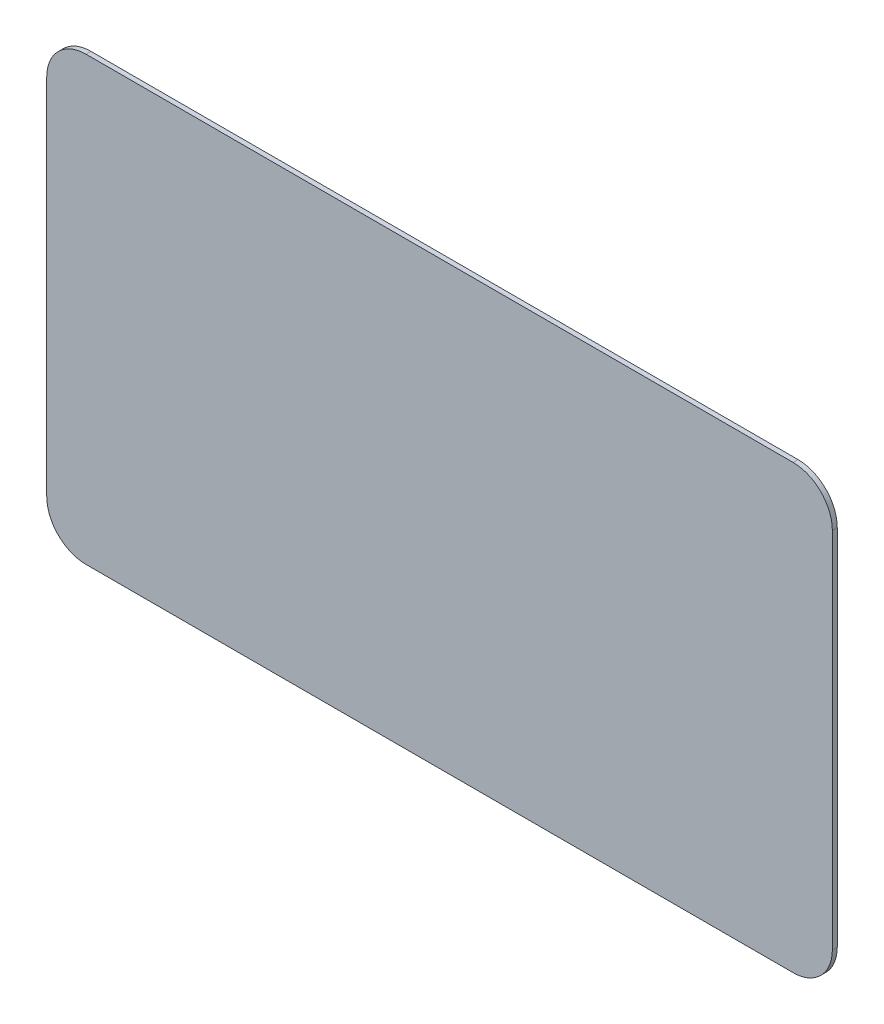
ISO-10303-21;
HEADER;
FILE_DESCRIPTION(('STEP AP214'),'2;1');
FILE_NAME('part.step','',(''),(''),'','','');
FILE_SCHEMA(('AUTOMOTIVE_DESIGN { 1 0 10303 214 1 1 1 1 }'));
ENDSEC;
DATA;
#1=APPLICATION_CONTEXT('core data for automotive mechanical design processes');
#2=APPLICATION_PROTOCOL_DEFINITION('international standard','automotive_design',2000,#1);
#3=PRODUCT_CONTEXT('',#1,'mechanical');
#4=PRODUCT('Part','Part','',(#3));
#5=PRODUCT_RELATED_PRODUCT_CATEGORY('part','',(#4));
#6=PRODUCT_DEFINITION_FORMATION('','',#4);
#7=PRODUCT_DEFINITION_CONTEXT('part definition',#1,'design');
#8=PRODUCT_DEFINITION('design','',#6,#7);
#9=PRODUCT_DEFINITION_SHAPE('','',#8);
#10=(LENGTH_UNIT() NAMED_UNIT(*) SI_UNIT(.MILLI.,.METRE.));
#11=(NAMED_UNIT(*) PLANE_ANGLE_UNIT() SI_UNIT($,.RADIAN.));
#12=(NAMED_UNIT(*) SI_UNIT($,.STERADIAN.) SOLID_ANGLE_UNIT());
#13=UNCERTAINTY_MEASURE_WITH_UNIT(LENGTH_MEASURE(1.E-05),#10,'distance_accuracy_value','');
#14=(GEOMETRIC_REPRESENTATION_CONTEXT(3) GLOBAL_UNCERTAINTY_ASSIGNED_CONTEXT((#13)) GLOBAL_UNIT_ASSIGNED_CONTEXT((#10,
#11,#12)) REPRESENTATION_CONTEXT('',''));
#15=CARTESIAN_POINT('',(0.,0.,0.));
#16=DIRECTION('',(0.,0.,1.));
#17=DIRECTION('',(1.,0.,0.));
#18=AXIS2_PLACEMENT_3D('',#15,#16,#17);
#19=CARTESIAN_POINT('',(-40.,-22.5,0.5));
#20=DIRECTION('',(1.,0.,0.));
#21=DIRECTION('',(0.,0.,-1.));
#22=AXIS2_PLACEMENT_3D('',#19,#20,#21);
#23=PLANE('',#22);
#24=DIRECTION('',(0.,-1.,0.));
#25=VECTOR('',#24,1.);
#26=CARTESIAN_POINT('',(-40.,-22.5,0.));
#27=LINE('',#26,#25);
#28=CARTESIAN_POINT('',(-40.,18.5,0.));
#29=VERTEX_POINT('',#28);
#30=CARTESIAN_POINT('',(-40.,-18.5,0.));
#31=VERTEX_POINT('',#30);
#32=EDGE_CURVE('E159',#29,#31,#27,.T.);
#33=ORIENTED_EDGE('',*,*,#32,.T.);
#34=DIRECTION('',(0.,0.,-1.));
#35=VECTOR('',#34,1.);
#36=CARTESIAN_POINT('',(-40.,-18.5,0.5));
#37=LINE('',#36,#35);
#38=CARTESIAN_POINT('',(-40.,-18.5,0.5));
#39=VERTEX_POINT('',#38);
#40=EDGE_CURVE('E11',#31,#39,#37,.F.);
#41=ORIENTED_EDGE('',*,*,#40,.T.);
#42=DIRECTION('',(0.,-1.,0.));
#43=VECTOR('',#42,1.);
#44=CARTESIAN_POINT('',(-40.,-22.5,0.5));
#45=LINE('',#44,#43);
#46=CARTESIAN_POINT('',(-40.,18.5,0.5));
#47=VERTEX_POINT('',#46);
#48=EDGE_CURVE('E127',#47,#39,#45,.T.);
#49=ORIENTED_EDGE('',*,*,#48,.F.);
#50=DIRECTION('',(0.,0.,-1.));
#51=VECTOR('',#50,1.);
#52=CARTESIAN_POINT('',(-40.,18.5,0.5));
#53=LINE('',#52,#51);
#54=EDGE_CURVE('E43',#47,#29,#53,.T.);
#55=ORIENTED_EDGE('',*,*,#54,.T.);
#56=EDGE_LOOP('',(#33,#41,#49,#55));
#57=FACE_BOUND('',#56,.T.);
#58=ADVANCED_FACE('F35',(#57),#23,.F.);
#59=CARTESIAN_POINT('',(-40.,-22.5,0.5));
#60=DIRECTION('',(0.,1.,0.));
#61=DIRECTION('',(-1.,0.,0.));
#62=AXIS2_PLACEMENT_3D('',#59,#60,#61);
#63=PLANE('',#62);
#64=DIRECTION('',(1.,0.,0.));
#65=VECTOR('',#64,1.);
#66=CARTESIAN_POINT('',(-40.,-22.5,0.));
#67=LINE('',#66,#65);
#68=CARTESIAN_POINT('',(-36.,-22.5,0.));
#69=VERTEX_POINT('',#68);
#70=CARTESIAN_POINT('',(36.,-22.5,0.));
#71=VERTEX_POINT('',#70);
#72=EDGE_CURVE('E132',#69,#71,#67,.T.);
#73=ORIENTED_EDGE('',*,*,#72,.T.);
#74=DIRECTION('',(0.,0.,-1.));
#75=VECTOR('',#74,1.);
#76=CARTESIAN_POINT('',(36.,-22.5,0.5));
#77=LINE('',#76,#75);
#78=CARTESIAN_POINT('',(36.,-22.5,0.5));
#79=VERTEX_POINT('',#78);
#80=EDGE_CURVE('E50',#71,#79,#77,.F.);
#81=ORIENTED_EDGE('',*,*,#80,.T.);
#82=DIRECTION('',(1.,0.,0.));
#83=VECTOR('',#82,1.);
#84=CARTESIAN_POINT('',(-40.,-22.5,0.5));
#85=LINE('',#84,#83);
#86=CARTESIAN_POINT('',(-36.,-22.5,0.5));
#87=VERTEX_POINT('',#86);
#88=EDGE_CURVE('E130',#87,#79,#85,.T.);
#89=ORIENTED_EDGE('',*,*,#88,.F.);
#90=DIRECTION('',(0.,0.,-1.));
#91=VECTOR('',#90,1.);
#92=CARTESIAN_POINT('',(-36.,-22.5,0.5));
#93=LINE('',#92,#91);
#94=EDGE_CURVE('E151',#87,#69,#93,.T.);
#95=ORIENTED_EDGE('',*,*,#94,.T.);
#96=EDGE_LOOP('',(#73,#81,#89,#95));
#97=FACE_BOUND('',#96,.T.);
#98=ADVANCED_FACE('F179',(#97),#63,.F.);
#99=CARTESIAN_POINT('',(40.,-22.5,0.5));
#100=DIRECTION('',(-1.,0.,0.));
#101=DIRECTION('',(0.,0.,1.));
#102=AXIS2_PLACEMENT_3D('',#99,#100,#101);
#103=PLANE('',#102);
#104=DIRECTION('',(0.,1.,0.));
#105=VECTOR('',#104,1.);
#106=CARTESIAN_POINT('',(40.,-22.5,0.));
#107=LINE('',#106,#105);
#108=CARTESIAN_POINT('',(40.,-18.5,0.));
#109=VERTEX_POINT('',#108);
#110=CARTESIAN_POINT('',(40.,18.5,0.));
#111=VERTEX_POINT('',#110);
#112=EDGE_CURVE('E128',#109,#111,#107,.T.);
#113=ORIENTED_EDGE('',*,*,#112,.T.);
#114=DIRECTION('',(0.,0.,-1.));
#115=VECTOR('',#114,1.);
#116=CARTESIAN_POINT('',(40.,18.5,0.5));
#117=LINE('',#116,#115);
#118=CARTESIAN_POINT('',(40.,18.5,0.5));
#119=VERTEX_POINT('',#118);
#120=EDGE_CURVE('E106',#111,#119,#117,.F.);
#121=ORIENTED_EDGE('',*,*,#120,.T.);
#122=DIRECTION('',(0.,1.,0.));
#123=VECTOR('',#122,1.);
#124=CARTESIAN_POINT('',(40.,-22.5,0.5));
#125=LINE('',#124,#123);
#126=CARTESIAN_POINT('',(40.,-18.5,0.5));
#127=VERTEX_POINT('',#126);
#128=EDGE_CURVE('E167',#127,#119,#125,.T.);
#129=ORIENTED_EDGE('',*,*,#128,.F.);
#130=DIRECTION('',(0.,0.,-1.));
#131=VECTOR('',#130,1.);
#132=CARTESIAN_POINT('',(40.,-18.5,0.5));
#133=LINE('',#132,#131);
#134=EDGE_CURVE('E111',#127,#109,#133,.T.);
#135=ORIENTED_EDGE('',*,*,#134,.T.);
#136=EDGE_LOOP('',(#113,#121,#129,#135));
#137=FACE_BOUND('',#136,.T.);
#138=ADVANCED_FACE('F178',(#137),#103,.F.);
#139=CARTESIAN_POINT('',(-40.,22.5,0.5));
#140=DIRECTION('',(0.,-1.,0.));
#141=DIRECTION('',(1.,0.,0.));
#142=AXIS2_PLACEMENT_3D('',#139,#140,#141);
#143=PLANE('',#142);
#144=DIRECTION('',(-1.,0.,0.));
#145=VECTOR('',#144,1.);
#146=CARTESIAN_POINT('',(-40.,22.5,0.5));
#147=LINE('',#146,#145);
#148=CARTESIAN_POINT('',(36.,22.5,0.5));
#149=VERTEX_POINT('',#148);
#150=CARTESIAN_POINT('',(-36.,22.5,0.5));
#151=VERTEX_POINT('',#150);
#152=EDGE_CURVE('E121',#149,#151,#147,.T.);
#153=ORIENTED_EDGE('',*,*,#152,.F.);
#154=DIRECTION('',(0.,0.,-1.));
#155=VECTOR('',#154,1.);
#156=CARTESIAN_POINT('',(36.,22.5,0.5));
#157=LINE('',#156,#155);
#158=CARTESIAN_POINT('',(36.,22.5,0.));
#159=VERTEX_POINT('',#158);
#160=EDGE_CURVE('E105',#149,#159,#157,.T.);
#161=ORIENTED_EDGE('',*,*,#160,.T.);
#162=DIRECTION('',(-1.,0.,0.));
#163=VECTOR('',#162,1.);
#164=CARTESIAN_POINT('',(-40.,22.5,0.));
#165=LINE('',#164,#163);
#166=CARTESIAN_POINT('',(-36.,22.5,0.));
#167=VERTEX_POINT('',#166);
#168=EDGE_CURVE('E118',#159,#167,#165,.T.);
#169=ORIENTED_EDGE('',*,*,#168,.T.);
#170=DIRECTION('',(0.,0.,-1.));
#171=VECTOR('',#170,1.);
#172=CARTESIAN_POINT('',(-36.,22.5,0.5));
#173=LINE('',#172,#171);
#174=EDGE_CURVE('E123',#167,#151,#173,.F.);
#175=ORIENTED_EDGE('',*,*,#174,.T.);
#176=EDGE_LOOP('',(#153,#161,#169,#175));
#177=FACE_BOUND('',#176,.T.);
#178=ADVANCED_FACE('F117',(#177),#143,.F.);
#179=CARTESIAN_POINT('',(0.,0.,0.5));
#180=DIRECTION('',(0.,0.,-1.));
#181=DIRECTION('',(-1.,0.,0.));
#182=AXIS2_PLACEMENT_3D('',#179,#180,#181);
#183=PLANE('',#182);
#184=ORIENTED_EDGE('',*,*,#128,.T.);
#185=CARTESIAN_POINT('',(36.,18.5,0.5));
#186=DIRECTION('',(0.,0.,-1.));
#187=DIRECTION('',(-1.,0.,0.));
#188=AXIS2_PLACEMENT_3D('',#185,#186,#187);
#189=CIRCLE('',#188,4.);
#190=EDGE_CURVE('E149',#119,#149,#189,.F.);
#191=ORIENTED_EDGE('',*,*,#190,.T.);
#192=ORIENTED_EDGE('',*,*,#152,.T.);
#193=CARTESIAN_POINT('',(-36.,18.5,0.5));
#194=DIRECTION('',(0.,0.,-1.));
#195=DIRECTION('',(-1.,0.,0.));
#196=AXIS2_PLACEMENT_3D('',#193,#194,#195);
#197=CIRCLE('',#196,4.);
#198=EDGE_CURVE('E144',#151,#47,#197,.F.);
#199=ORIENTED_EDGE('',*,*,#198,.T.);
#200=ORIENTED_EDGE('',*,*,#48,.T.);
#201=CARTESIAN_POINT('',(-36.,-18.5,0.5));
#202=DIRECTION('',(0.,0.,-1.));
#203=DIRECTION('',(-1.,0.,0.));
#204=AXIS2_PLACEMENT_3D('',#201,#202,#203);
#205=CIRCLE('',#204,4.);
#206=EDGE_CURVE('E57',#39,#87,#205,.F.);
#207=ORIENTED_EDGE('',*,*,#206,.T.);
#208=ORIENTED_EDGE('',*,*,#88,.T.);
#209=CARTESIAN_POINT('',(36.,-18.5,0.5));
#210=DIRECTION('',(0.,0.,-1.));
#211=DIRECTION('',(-1.,0.,0.));
#212=AXIS2_PLACEMENT_3D('',#209,#210,#211);
#213=CIRCLE('',#212,4.);
#214=EDGE_CURVE('E147',#79,#127,#213,.F.);
#215=ORIENTED_EDGE('',*,*,#214,.T.);
#216=EDGE_LOOP('',(#184,#191,#192,#199,#200,#207,#208,#215));
#217=FACE_BOUND('',#216,.T.);
#218=ADVANCED_FACE('F171',(#217),#183,.F.);
#219=CARTESIAN_POINT('',(0.,0.,0.));
#220=DIRECTION('',(0.,0.,-1.));
#221=DIRECTION('',(-1.,0.,0.));
#222=AXIS2_PLACEMENT_3D('',#219,#220,#221);
#223=PLANE('',#222);
#224=ORIENTED_EDGE('',*,*,#168,.F.);
#225=CARTESIAN_POINT('',(36.,18.5,0.));
#226=DIRECTION('',(0.,0.,-1.));
#227=DIRECTION('',(-1.,0.,0.));
#228=AXIS2_PLACEMENT_3D('',#225,#226,#227);
#229=CIRCLE('',#228,4.);
#230=EDGE_CURVE('E101',#159,#111,#229,.T.);
#231=ORIENTED_EDGE('',*,*,#230,.T.);
#232=ORIENTED_EDGE('',*,*,#112,.F.);
#233=CARTESIAN_POINT('',(36.,-18.5,0.));
#234=DIRECTION('',(0.,0.,-1.));
#235=DIRECTION('',(-1.,0.,0.));
#236=AXIS2_PLACEMENT_3D('',#233,#234,#235);
#237=CIRCLE('',#236,4.);
#238=EDGE_CURVE('E112',#109,#71,#237,.T.);
#239=ORIENTED_EDGE('',*,*,#238,.T.);
#240=ORIENTED_EDGE('',*,*,#72,.F.);
#241=CARTESIAN_POINT('',(-36.,-18.5,0.));
#242=DIRECTION('',(0.,0.,-1.));
#243=DIRECTION('',(-1.,0.,0.));
#244=AXIS2_PLACEMENT_3D('',#241,#242,#243);
#245=CIRCLE('',#244,4.);
#246=EDGE_CURVE('E138',#69,#31,#245,.T.);
#247=ORIENTED_EDGE('',*,*,#246,.T.);
#248=ORIENTED_EDGE('',*,*,#32,.F.);
#249=CARTESIAN_POINT('',(-36.,18.5,0.));
#250=DIRECTION('',(0.,0.,-1.));
#251=DIRECTION('',(-1.,0.,0.));
#252=AXIS2_PLACEMENT_3D('',#249,#250,#251);
#253=CIRCLE('',#252,4.);
#254=EDGE_CURVE('E122',#29,#167,#253,.T.);
#255=ORIENTED_EDGE('',*,*,#254,.T.);
#256=EDGE_LOOP('',(#224,#231,#232,#239,#240,#247,#248,#255));
#257=FACE_BOUND('',#256,.T.);
#258=ADVANCED_FACE('F125',(#257),#223,.T.);
#259=CARTESIAN_POINT('',(36.,18.5,0.5));
#260=DIRECTION('',(0.,0.,-1.));
#261=DIRECTION('',(-1.,0.,0.));
#262=AXIS2_PLACEMENT_3D('',#259,#260,#261);
#263=CYLINDRICAL_SURFACE('',#262,4.);
#264=ORIENTED_EDGE('',*,*,#190,.F.);
#265=ORIENTED_EDGE('',*,*,#120,.F.);
#266=ORIENTED_EDGE('',*,*,#230,.F.);
#267=ORIENTED_EDGE('',*,*,#160,.F.);
#268=EDGE_LOOP('',(#264,#265,#266,#267));
#269=FACE_BOUND('',#268,.T.);
#270=ADVANCED_FACE('F104',(#269),#263,.T.);
#271=CARTESIAN_POINT('',(36.,-18.5,0.5));
#272=DIRECTION('',(0.,0.,-1.));
#273=DIRECTION('',(-1.,0.,0.));
#274=AXIS2_PLACEMENT_3D('',#271,#272,#273);
#275=CYLINDRICAL_SURFACE('',#274,4.);
#276=ORIENTED_EDGE('',*,*,#214,.F.);
#277=ORIENTED_EDGE('',*,*,#80,.F.);
#278=ORIENTED_EDGE('',*,*,#238,.F.);
#279=ORIENTED_EDGE('',*,*,#134,.F.);
#280=EDGE_LOOP('',(#276,#277,#278,#279));
#281=FACE_BOUND('',#280,.T.);
#282=ADVANCED_FACE('F176',(#281),#275,.T.);
#283=CARTESIAN_POINT('',(-36.,-18.5,0.5));
#284=DIRECTION('',(0.,0.,-1.));
#285=DIRECTION('',(-1.,0.,0.));
#286=AXIS2_PLACEMENT_3D('',#283,#284,#285);
#287=CYLINDRICAL_SURFACE('',#286,4.);
#288=ORIENTED_EDGE('',*,*,#206,.F.);
#289=ORIENTED_EDGE('',*,*,#40,.F.);
#290=ORIENTED_EDGE('',*,*,#246,.F.);
#291=ORIENTED_EDGE('',*,*,#94,.F.);
#292=EDGE_LOOP('',(#288,#289,#290,#291));
#293=FACE_BOUND('',#292,.T.);
#294=ADVANCED_FACE('F181',(#293),#287,.T.);
#295=CARTESIAN_POINT('',(-36.,18.5,0.5));
#296=DIRECTION('',(0.,0.,-1.));
#297=DIRECTION('',(-1.,0.,0.));
#298=AXIS2_PLACEMENT_3D('',#295,#296,#297);
#299=CYLINDRICAL_SURFACE('',#298,4.);
#300=ORIENTED_EDGE('',*,*,#198,.F.);
#301=ORIENTED_EDGE('',*,*,#174,.F.);
#302=ORIENTED_EDGE('',*,*,#254,.F.);
#303=ORIENTED_EDGE('',*,*,#54,.F.);
#304=EDGE_LOOP('',(#300,#301,#302,#303));
#305=FACE_BOUND('',#304,.T.);
#306=ADVANCED_FACE('F37',(#305),#299,.T.);
#307=CLOSED_SHELL('',(#58,#98,#138,#178,#218,#258,#270,#282,#294,#306));
#308=MANIFOLD_SOLID_BREP('B2',#307);
#309=ADVANCED_BREP_SHAPE_REPRESENTATION('',(#18,#308),#14);
#310=SHAPE_DEFINITION_REPRESENTATION(#9,#309);
ENDSEC;
END-ISO-10303-21;
